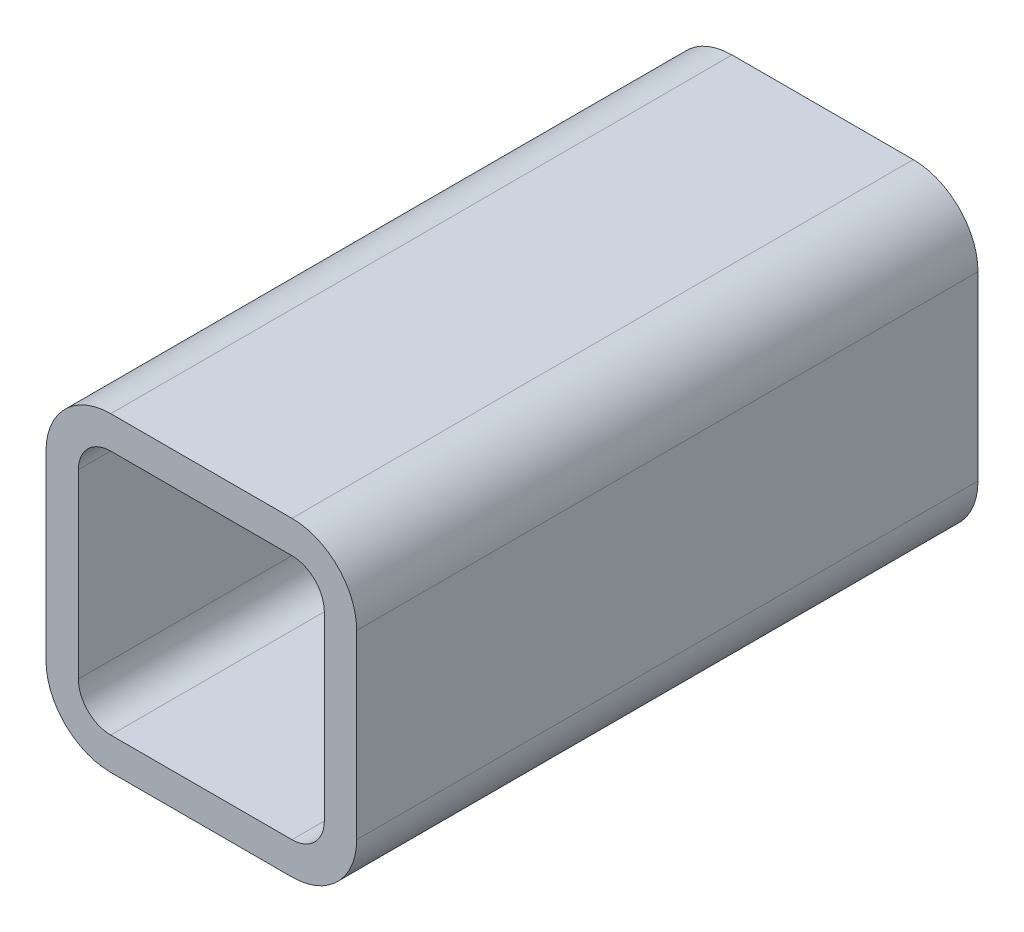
ISO-10303-21;
HEADER;
FILE_DESCRIPTION(('STEP AP214'),'2;1');
FILE_NAME('part.step','',(''),(''),'','','');
FILE_SCHEMA(('AUTOMOTIVE_DESIGN { 1 0 10303 214 1 1 1 1 }'));
ENDSEC;
DATA;
#1=APPLICATION_CONTEXT('core data for automotive mechanical design processes');
#2=APPLICATION_PROTOCOL_DEFINITION('international standard','automotive_design',2000,#1);
#3=PRODUCT_CONTEXT('',#1,'mechanical');
#4=PRODUCT('Part','Part','',(#3));
#5=PRODUCT_RELATED_PRODUCT_CATEGORY('part','',(#4));
#6=PRODUCT_DEFINITION_FORMATION('','',#4);
#7=PRODUCT_DEFINITION_CONTEXT('part definition',#1,'design');
#8=PRODUCT_DEFINITION('design','',#6,#7);
#9=PRODUCT_DEFINITION_SHAPE('','',#8);
#10=(LENGTH_UNIT() NAMED_UNIT(*) SI_UNIT(.MILLI.,.METRE.));
#11=(NAMED_UNIT(*) PLANE_ANGLE_UNIT() SI_UNIT($,.RADIAN.));
#12=(NAMED_UNIT(*) SI_UNIT($,.STERADIAN.) SOLID_ANGLE_UNIT());
#13=UNCERTAINTY_MEASURE_WITH_UNIT(LENGTH_MEASURE(1.E-05),#10,'distance_accuracy_value','');
#14=(GEOMETRIC_REPRESENTATION_CONTEXT(3) GLOBAL_UNCERTAINTY_ASSIGNED_CONTEXT((#13)) GLOBAL_UNIT_ASSIGNED_CONTEXT((#10,
#11,#12)) REPRESENTATION_CONTEXT('',''));
#15=CARTESIAN_POINT('',(0.,0.,0.));
#16=DIRECTION('',(0.,0.,1.));
#17=DIRECTION('',(1.,0.,0.));
#18=AXIS2_PLACEMENT_3D('',#15,#16,#17);
#19=CARTESIAN_POINT('',(31.7973013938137,122.661948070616,304.8));
#20=DIRECTION('',(0.,0.,1.));
#21=DIRECTION('',(1.,0.,0.));
#22=AXIS2_PLACEMENT_3D('',#19,#20,#21);
#23=PLANE('',#22);
#24=CARTESIAN_POINT('',(31.7973013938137,122.661948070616,304.8));
#25=DIRECTION('',(0.,0.,1.));
#26=DIRECTION('',(1.,0.,0.));
#27=AXIS2_PLACEMENT_3D('',#24,#25,#26);
#28=CIRCLE('',#27,31.75);
#29=CARTESIAN_POINT('',(31.7973013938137,154.411948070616,304.8));
#30=VERTEX_POINT('',#29);
#31=CARTESIAN_POINT('',(0.0473013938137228,122.661948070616,304.8));
#32=VERTEX_POINT('',#31);
#33=EDGE_CURVE('E211',#30,#32,#28,.T.);
#34=ORIENTED_EDGE('',*,*,#33,.T.);
#35=DIRECTION('',(0.,-1.,0.));
#36=VECTOR('',#35,1.);
#37=CARTESIAN_POINT('',(0.0473013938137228,122.661948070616,304.8));
#38=LINE('',#37,#36);
#39=CARTESIAN_POINT('',(0.0473013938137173,33.7619480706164,304.8));
#40=VERTEX_POINT('',#39);
#41=EDGE_CURVE('E214',#32,#40,#38,.T.);
#42=ORIENTED_EDGE('',*,*,#41,.T.);
#43=CARTESIAN_POINT('',(31.7973013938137,33.7619480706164,304.8));
#44=DIRECTION('',(0.,0.,1.));
#45=DIRECTION('',(1.,0.,0.));
#46=AXIS2_PLACEMENT_3D('',#43,#44,#45);
#47=CIRCLE('',#46,31.75);
#48=CARTESIAN_POINT('',(31.7973013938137,2.01194807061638,304.8));
#49=VERTEX_POINT('',#48);
#50=EDGE_CURVE('E217',#40,#49,#47,.T.);
#51=ORIENTED_EDGE('',*,*,#50,.T.);
#52=DIRECTION('',(1.,0.,0.));
#53=VECTOR('',#52,1.);
#54=CARTESIAN_POINT('',(31.7973013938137,2.01194807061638,304.8));
#55=LINE('',#54,#53);
#56=CARTESIAN_POINT('',(120.697301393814,2.01194807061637,304.8));
#57=VERTEX_POINT('',#56);
#58=EDGE_CURVE('E219',#49,#57,#55,.T.);
#59=ORIENTED_EDGE('',*,*,#58,.T.);
#60=CARTESIAN_POINT('',(120.697301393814,33.7619480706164,304.8));
#61=DIRECTION('',(0.,0.,1.));
#62=DIRECTION('',(1.,0.,0.));
#63=AXIS2_PLACEMENT_3D('',#60,#61,#62);
#64=CIRCLE('',#63,31.75);
#65=CARTESIAN_POINT('',(152.447301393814,33.7619480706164,304.8));
#66=VERTEX_POINT('',#65);
#67=EDGE_CURVE('E221',#57,#66,#64,.T.);
#68=ORIENTED_EDGE('',*,*,#67,.T.);
#69=DIRECTION('',(0.,1.,0.));
#70=VECTOR('',#69,1.);
#71=CARTESIAN_POINT('',(152.447301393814,33.7619480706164,304.8));
#72=LINE('',#71,#70);
#73=CARTESIAN_POINT('',(152.447301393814,122.661948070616,304.8));
#74=VERTEX_POINT('',#73);
#75=EDGE_CURVE('E223',#66,#74,#72,.T.);
#76=ORIENTED_EDGE('',*,*,#75,.T.);
#77=CARTESIAN_POINT('',(120.697301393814,122.661948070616,304.8));
#78=DIRECTION('',(0.,0.,1.));
#79=DIRECTION('',(1.,0.,0.));
#80=AXIS2_PLACEMENT_3D('',#77,#78,#79);
#81=CIRCLE('',#80,31.75);
#82=CARTESIAN_POINT('',(120.697301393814,154.411948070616,304.8));
#83=VERTEX_POINT('',#82);
#84=EDGE_CURVE('E225',#74,#83,#81,.T.);
#85=ORIENTED_EDGE('',*,*,#84,.T.);
#86=DIRECTION('',(-1.,0.,0.));
#87=VECTOR('',#86,1.);
#88=CARTESIAN_POINT('',(120.697301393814,154.411948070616,304.8));
#89=LINE('',#88,#87);
#90=EDGE_CURVE('E227',#83,#30,#89,.T.);
#91=ORIENTED_EDGE('',*,*,#90,.T.);
#92=EDGE_LOOP('',(#34,#42,#51,#59,#68,#76,#85,#91));
#93=FACE_BOUND('',#92,.T.);
#94=DIRECTION('',(0.,-1.,0.));
#95=VECTOR('',#94,1.);
#96=CARTESIAN_POINT('',(15.9223013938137,33.7619480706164,304.8));
#97=LINE('',#96,#95);
#98=CARTESIAN_POINT('',(15.9223013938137,122.661948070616,304.8));
#99=VERTEX_POINT('',#98);
#100=CARTESIAN_POINT('',(15.9223013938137,33.7619480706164,304.8));
#101=VERTEX_POINT('',#100);
#102=EDGE_CURVE('E154',#99,#101,#97,.T.);
#103=ORIENTED_EDGE('',*,*,#102,.F.);
#104=CARTESIAN_POINT('',(31.7973013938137,122.661948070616,304.8));
#105=DIRECTION('',(0.,0.,1.));
#106=DIRECTION('',(1.,0.,0.));
#107=AXIS2_PLACEMENT_3D('',#104,#105,#106);
#108=CIRCLE('',#107,15.875);
#109=CARTESIAN_POINT('',(31.7973013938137,138.536948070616,304.8));
#110=VERTEX_POINT('',#109);
#111=EDGE_CURVE('E146',#110,#99,#108,.T.);
#112=ORIENTED_EDGE('',*,*,#111,.F.);
#113=DIRECTION('',(-1.,0.,0.));
#114=VECTOR('',#113,1.);
#115=CARTESIAN_POINT('',(31.7973013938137,138.536948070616,304.8));
#116=LINE('',#115,#114);
#117=CARTESIAN_POINT('',(120.697301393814,138.536948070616,304.8));
#118=VERTEX_POINT('',#117);
#119=EDGE_CURVE('E179',#118,#110,#116,.T.);
#120=ORIENTED_EDGE('',*,*,#119,.F.);
#121=CARTESIAN_POINT('',(120.697301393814,122.661948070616,304.8));
#122=DIRECTION('',(0.,0.,1.));
#123=DIRECTION('',(1.,0.,0.));
#124=AXIS2_PLACEMENT_3D('',#121,#122,#123);
#125=CIRCLE('',#124,15.875);
#126=CARTESIAN_POINT('',(136.572301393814,122.661948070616,304.8));
#127=VERTEX_POINT('',#126);
#128=EDGE_CURVE('E177',#127,#118,#125,.T.);
#129=ORIENTED_EDGE('',*,*,#128,.F.);
#130=DIRECTION('',(0.,1.,0.));
#131=VECTOR('',#130,1.);
#132=CARTESIAN_POINT('',(136.572301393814,122.661948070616,304.8));
#133=LINE('',#132,#131);
#134=CARTESIAN_POINT('',(136.572301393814,33.7619480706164,304.8));
#135=VERTEX_POINT('',#134);
#136=EDGE_CURVE('E175',#135,#127,#133,.T.);
#137=ORIENTED_EDGE('',*,*,#136,.F.);
#138=CARTESIAN_POINT('',(120.697301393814,33.7619480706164,304.8));
#139=DIRECTION('',(0.,0.,1.));
#140=DIRECTION('',(1.,0.,0.));
#141=AXIS2_PLACEMENT_3D('',#138,#139,#140);
#142=CIRCLE('',#141,15.875);
#143=CARTESIAN_POINT('',(120.697301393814,17.8869480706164,304.8));
#144=VERTEX_POINT('',#143);
#145=EDGE_CURVE('E173',#144,#135,#142,.T.);
#146=ORIENTED_EDGE('',*,*,#145,.F.);
#147=DIRECTION('',(1.,0.,0.));
#148=VECTOR('',#147,1.);
#149=CARTESIAN_POINT('',(120.697301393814,17.8869480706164,304.8));
#150=LINE('',#149,#148);
#151=CARTESIAN_POINT('',(31.7973013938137,17.8869480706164,304.8));
#152=VERTEX_POINT('',#151);
#153=EDGE_CURVE('E169',#152,#144,#150,.T.);
#154=ORIENTED_EDGE('',*,*,#153,.F.);
#155=CARTESIAN_POINT('',(31.7973013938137,33.7619480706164,304.8));
#156=DIRECTION('',(0.,0.,1.));
#157=DIRECTION('',(1.,0.,0.));
#158=AXIS2_PLACEMENT_3D('',#155,#156,#157);
#159=CIRCLE('',#158,15.875);
#160=EDGE_CURVE('E167',#101,#152,#159,.T.);
#161=ORIENTED_EDGE('',*,*,#160,.F.);
#162=EDGE_LOOP('',(#103,#112,#120,#129,#137,#146,#154,#161));
#163=FACE_BOUND('',#162,.T.);
#164=ADVANCED_FACE('F33',(#93,#163),#23,.T.);
#165=CARTESIAN_POINT('',(31.7973013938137,122.661948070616,0.));
#166=DIRECTION('',(0.,0.,1.));
#167=DIRECTION('',(1.,0.,0.));
#168=AXIS2_PLACEMENT_3D('',#165,#166,#167);
#169=PLANE('',#168);
#170=CARTESIAN_POINT('',(31.7973013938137,122.661948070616,0.));
#171=DIRECTION('',(0.,0.,1.));
#172=DIRECTION('',(1.,0.,0.));
#173=AXIS2_PLACEMENT_3D('',#170,#171,#172);
#174=CIRCLE('',#173,31.75);
#175=CARTESIAN_POINT('',(31.7973013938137,154.411948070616,0.));
#176=VERTEX_POINT('',#175);
#177=CARTESIAN_POINT('',(0.0473013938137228,122.661948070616,0.));
#178=VERTEX_POINT('',#177);
#179=EDGE_CURVE('E162',#176,#178,#174,.T.);
#180=ORIENTED_EDGE('',*,*,#179,.F.);
#181=DIRECTION('',(-1.,0.,0.));
#182=VECTOR('',#181,1.);
#183=CARTESIAN_POINT('',(120.697301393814,154.411948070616,0.));
#184=LINE('',#183,#182);
#185=CARTESIAN_POINT('',(120.697301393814,154.411948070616,0.));
#186=VERTEX_POINT('',#185);
#187=EDGE_CURVE('E215',#186,#176,#184,.T.);
#188=ORIENTED_EDGE('',*,*,#187,.F.);
#189=CARTESIAN_POINT('',(120.697301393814,122.661948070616,0.));
#190=DIRECTION('',(0.,0.,1.));
#191=DIRECTION('',(1.,0.,0.));
#192=AXIS2_PLACEMENT_3D('',#189,#190,#191);
#193=CIRCLE('',#192,31.75);
#194=CARTESIAN_POINT('',(152.447301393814,122.661948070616,0.));
#195=VERTEX_POINT('',#194);
#196=EDGE_CURVE('E242',#195,#186,#193,.T.);
#197=ORIENTED_EDGE('',*,*,#196,.F.);
#198=DIRECTION('',(0.,1.,0.));
#199=VECTOR('',#198,1.);
#200=CARTESIAN_POINT('',(152.447301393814,33.7619480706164,0.));
#201=LINE('',#200,#199);
#202=CARTESIAN_POINT('',(152.447301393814,33.7619480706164,0.));
#203=VERTEX_POINT('',#202);
#204=EDGE_CURVE('E240',#203,#195,#201,.T.);
#205=ORIENTED_EDGE('',*,*,#204,.F.);
#206=CARTESIAN_POINT('',(120.697301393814,33.7619480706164,0.));
#207=DIRECTION('',(0.,0.,1.));
#208=DIRECTION('',(1.,0.,0.));
#209=AXIS2_PLACEMENT_3D('',#206,#207,#208);
#210=CIRCLE('',#209,31.75);
#211=CARTESIAN_POINT('',(120.697301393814,2.01194807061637,0.));
#212=VERTEX_POINT('',#211);
#213=EDGE_CURVE('E238',#212,#203,#210,.T.);
#214=ORIENTED_EDGE('',*,*,#213,.F.);
#215=DIRECTION('',(1.,0.,0.));
#216=VECTOR('',#215,1.);
#217=CARTESIAN_POINT('',(31.7973013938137,2.01194807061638,0.));
#218=LINE('',#217,#216);
#219=CARTESIAN_POINT('',(31.7973013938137,2.01194807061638,0.));
#220=VERTEX_POINT('',#219);
#221=EDGE_CURVE('E236',#220,#212,#218,.T.);
#222=ORIENTED_EDGE('',*,*,#221,.F.);
#223=CARTESIAN_POINT('',(31.7973013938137,33.7619480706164,0.));
#224=DIRECTION('',(0.,0.,1.));
#225=DIRECTION('',(1.,0.,0.));
#226=AXIS2_PLACEMENT_3D('',#223,#224,#225);
#227=CIRCLE('',#226,31.75);
#228=CARTESIAN_POINT('',(0.0473013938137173,33.7619480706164,0.));
#229=VERTEX_POINT('',#228);
#230=EDGE_CURVE('E234',#229,#220,#227,.T.);
#231=ORIENTED_EDGE('',*,*,#230,.F.);
#232=DIRECTION('',(0.,-1.,0.));
#233=VECTOR('',#232,1.);
#234=CARTESIAN_POINT('',(0.0473013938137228,122.661948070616,0.));
#235=LINE('',#234,#233);
#236=EDGE_CURVE('E232',#178,#229,#235,.T.);
#237=ORIENTED_EDGE('',*,*,#236,.F.);
#238=EDGE_LOOP('',(#180,#188,#197,#205,#214,#222,#231,#237));
#239=FACE_BOUND('',#238,.T.);
#240=CARTESIAN_POINT('',(31.7973013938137,122.661948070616,0.));
#241=DIRECTION('',(0.,0.,1.));
#242=DIRECTION('',(1.,0.,0.));
#243=AXIS2_PLACEMENT_3D('',#240,#241,#242);
#244=CIRCLE('',#243,15.875);
#245=CARTESIAN_POINT('',(31.7973013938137,138.536948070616,0.));
#246=VERTEX_POINT('',#245);
#247=CARTESIAN_POINT('',(15.9223013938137,122.661948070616,0.));
#248=VERTEX_POINT('',#247);
#249=EDGE_CURVE('E56',#246,#248,#244,.T.);
#250=ORIENTED_EDGE('',*,*,#249,.T.);
#251=DIRECTION('',(0.,-1.,0.));
#252=VECTOR('',#251,1.);
#253=CARTESIAN_POINT('',(15.9223013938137,33.7619480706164,0.));
#254=LINE('',#253,#252);
#255=CARTESIAN_POINT('',(15.9223013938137,33.7619480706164,0.));
#256=VERTEX_POINT('',#255);
#257=EDGE_CURVE('E161',#248,#256,#254,.T.);
#258=ORIENTED_EDGE('',*,*,#257,.T.);
#259=CARTESIAN_POINT('',(31.7973013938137,33.7619480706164,0.));
#260=DIRECTION('',(0.,0.,1.));
#261=DIRECTION('',(1.,0.,0.));
#262=AXIS2_PLACEMENT_3D('',#259,#260,#261);
#263=CIRCLE('',#262,15.875);
#264=CARTESIAN_POINT('',(31.7973013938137,17.8869480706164,0.));
#265=VERTEX_POINT('',#264);
#266=EDGE_CURVE('E183',#256,#265,#263,.T.);
#267=ORIENTED_EDGE('',*,*,#266,.T.);
#268=DIRECTION('',(1.,0.,0.));
#269=VECTOR('',#268,1.);
#270=CARTESIAN_POINT('',(120.697301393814,17.8869480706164,0.));
#271=LINE('',#270,#269);
#272=CARTESIAN_POINT('',(120.697301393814,17.8869480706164,0.));
#273=VERTEX_POINT('',#272);
#274=EDGE_CURVE('E186',#265,#273,#271,.T.);
#275=ORIENTED_EDGE('',*,*,#274,.T.);
#276=CARTESIAN_POINT('',(120.697301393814,33.7619480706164,0.));
#277=DIRECTION('',(0.,0.,1.));
#278=DIRECTION('',(1.,0.,0.));
#279=AXIS2_PLACEMENT_3D('',#276,#277,#278);
#280=CIRCLE('',#279,15.875);
#281=CARTESIAN_POINT('',(136.572301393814,33.7619480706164,0.));
#282=VERTEX_POINT('',#281);
#283=EDGE_CURVE('E189',#273,#282,#280,.T.);
#284=ORIENTED_EDGE('',*,*,#283,.T.);
#285=DIRECTION('',(0.,1.,0.));
#286=VECTOR('',#285,1.);
#287=CARTESIAN_POINT('',(136.572301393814,122.661948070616,0.));
#288=LINE('',#287,#286);
#289=CARTESIAN_POINT('',(136.572301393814,122.661948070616,0.));
#290=VERTEX_POINT('',#289);
#291=EDGE_CURVE('E192',#282,#290,#288,.T.);
#292=ORIENTED_EDGE('',*,*,#291,.T.);
#293=CARTESIAN_POINT('',(120.697301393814,122.661948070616,0.));
#294=DIRECTION('',(0.,0.,1.));
#295=DIRECTION('',(1.,0.,0.));
#296=AXIS2_PLACEMENT_3D('',#293,#294,#295);
#297=CIRCLE('',#296,15.875);
#298=CARTESIAN_POINT('',(120.697301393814,138.536948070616,0.));
#299=VERTEX_POINT('',#298);
#300=EDGE_CURVE('E195',#290,#299,#297,.T.);
#301=ORIENTED_EDGE('',*,*,#300,.T.);
#302=DIRECTION('',(-1.,0.,0.));
#303=VECTOR('',#302,1.);
#304=CARTESIAN_POINT('',(31.7973013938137,138.536948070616,0.));
#305=LINE('',#304,#303);
#306=EDGE_CURVE('E155',#299,#246,#305,.T.);
#307=ORIENTED_EDGE('',*,*,#306,.T.);
#308=EDGE_LOOP('',(#250,#258,#267,#275,#284,#292,#301,#307));
#309=FACE_BOUND('',#308,.T.);
#310=ADVANCED_FACE('F272',(#239,#309),#169,.F.);
#311=CARTESIAN_POINT('',(31.7973013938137,122.661948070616,304.8));
#312=DIRECTION('',(0.,0.,-1.));
#313=DIRECTION('',(-1.,0.,0.));
#314=AXIS2_PLACEMENT_3D('',#311,#312,#313);
#315=CYLINDRICAL_SURFACE('',#314,31.75);
#316=ORIENTED_EDGE('',*,*,#179,.T.);
#317=DIRECTION('',(0.,0.,-1.));
#318=VECTOR('',#317,1.);
#319=CARTESIAN_POINT('',(0.0473013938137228,122.661948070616,304.8));
#320=LINE('',#319,#318);
#321=EDGE_CURVE('E11',#32,#178,#320,.T.);
#322=ORIENTED_EDGE('',*,*,#321,.F.);
#323=ORIENTED_EDGE('',*,*,#33,.F.);
#324=DIRECTION('',(0.,0.,-1.));
#325=VECTOR('',#324,1.);
#326=CARTESIAN_POINT('',(31.7973013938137,154.411948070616,304.8));
#327=LINE('',#326,#325);
#328=EDGE_CURVE('E229',#30,#176,#327,.T.);
#329=ORIENTED_EDGE('',*,*,#328,.T.);
#330=EDGE_LOOP('',(#316,#322,#323,#329));
#331=FACE_BOUND('',#330,.T.);
#332=ADVANCED_FACE('F35',(#331),#315,.T.);
#333=CARTESIAN_POINT('',(0.0473013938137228,122.661948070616,304.8));
#334=DIRECTION('',(1.,0.,0.));
#335=DIRECTION('',(0.,0.,-1.));
#336=AXIS2_PLACEMENT_3D('',#333,#334,#335);
#337=PLANE('',#336);
#338=ORIENTED_EDGE('',*,*,#236,.T.);
#339=DIRECTION('',(0.,0.,-1.));
#340=VECTOR('',#339,1.);
#341=CARTESIAN_POINT('',(0.0473013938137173,33.7619480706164,304.8));
#342=LINE('',#341,#340);
#343=EDGE_CURVE('E41',#40,#229,#342,.T.);
#344=ORIENTED_EDGE('',*,*,#343,.F.);
#345=ORIENTED_EDGE('',*,*,#41,.F.);
#346=ORIENTED_EDGE('',*,*,#321,.T.);
#347=EDGE_LOOP('',(#338,#344,#345,#346));
#348=FACE_BOUND('',#347,.T.);
#349=ADVANCED_FACE('F289',(#348),#337,.F.);
#350=CARTESIAN_POINT('',(31.7973013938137,33.7619480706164,304.8));
#351=DIRECTION('',(0.,0.,-1.));
#352=DIRECTION('',(-1.,0.,0.));
#353=AXIS2_PLACEMENT_3D('',#350,#351,#352);
#354=CYLINDRICAL_SURFACE('',#353,31.75);
#355=ORIENTED_EDGE('',*,*,#230,.T.);
#356=DIRECTION('',(0.,0.,-1.));
#357=VECTOR('',#356,1.);
#358=CARTESIAN_POINT('',(31.7973013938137,2.01194807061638,304.8));
#359=LINE('',#358,#357);
#360=EDGE_CURVE('E259',#49,#220,#359,.T.);
#361=ORIENTED_EDGE('',*,*,#360,.F.);
#362=ORIENTED_EDGE('',*,*,#50,.F.);
#363=ORIENTED_EDGE('',*,*,#343,.T.);
#364=EDGE_LOOP('',(#355,#361,#362,#363));
#365=FACE_BOUND('',#364,.T.);
#366=ADVANCED_FACE('F266',(#365),#354,.T.);
#367=CARTESIAN_POINT('',(31.7973013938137,2.01194807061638,304.8));
#368=DIRECTION('',(0.,1.,0.));
#369=DIRECTION('',(0.,0.,1.));
#370=AXIS2_PLACEMENT_3D('',#367,#368,#369);
#371=PLANE('',#370);
#372=ORIENTED_EDGE('',*,*,#221,.T.);
#373=DIRECTION('',(0.,0.,-1.));
#374=VECTOR('',#373,1.);
#375=CARTESIAN_POINT('',(120.697301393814,2.01194807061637,304.8));
#376=LINE('',#375,#374);
#377=EDGE_CURVE('E256',#57,#212,#376,.T.);
#378=ORIENTED_EDGE('',*,*,#377,.F.);
#379=ORIENTED_EDGE('',*,*,#58,.F.);
#380=ORIENTED_EDGE('',*,*,#360,.T.);
#381=EDGE_LOOP('',(#372,#378,#379,#380));
#382=FACE_BOUND('',#381,.T.);
#383=ADVANCED_FACE('F278',(#382),#371,.F.);
#384=CARTESIAN_POINT('',(120.697301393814,33.7619480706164,304.8));
#385=DIRECTION('',(0.,0.,-1.));
#386=DIRECTION('',(-1.,0.,0.));
#387=AXIS2_PLACEMENT_3D('',#384,#385,#386);
#388=CYLINDRICAL_SURFACE('',#387,31.75);
#389=ORIENTED_EDGE('',*,*,#213,.T.);
#390=DIRECTION('',(0.,0.,-1.));
#391=VECTOR('',#390,1.);
#392=CARTESIAN_POINT('',(152.447301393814,33.7619480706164,304.8));
#393=LINE('',#392,#391);
#394=EDGE_CURVE('E253',#66,#203,#393,.T.);
#395=ORIENTED_EDGE('',*,*,#394,.F.);
#396=ORIENTED_EDGE('',*,*,#67,.F.);
#397=ORIENTED_EDGE('',*,*,#377,.T.);
#398=EDGE_LOOP('',(#389,#395,#396,#397));
#399=FACE_BOUND('',#398,.T.);
#400=ADVANCED_FACE('F282',(#399),#388,.T.);
#401=CARTESIAN_POINT('',(152.447301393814,33.7619480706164,304.8));
#402=DIRECTION('',(-1.,0.,0.));
#403=DIRECTION('',(0.,0.,1.));
#404=AXIS2_PLACEMENT_3D('',#401,#402,#403);
#405=PLANE('',#404);
#406=ORIENTED_EDGE('',*,*,#204,.T.);
#407=DIRECTION('',(0.,0.,-1.));
#408=VECTOR('',#407,1.);
#409=CARTESIAN_POINT('',(152.447301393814,122.661948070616,304.8));
#410=LINE('',#409,#408);
#411=EDGE_CURVE('E250',#74,#195,#410,.T.);
#412=ORIENTED_EDGE('',*,*,#411,.F.);
#413=ORIENTED_EDGE('',*,*,#75,.F.);
#414=ORIENTED_EDGE('',*,*,#394,.T.);
#415=EDGE_LOOP('',(#406,#412,#413,#414));
#416=FACE_BOUND('',#415,.T.);
#417=ADVANCED_FACE('F302',(#416),#405,.F.);
#418=CARTESIAN_POINT('',(120.697301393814,122.661948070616,304.8));
#419=DIRECTION('',(0.,0.,-1.));
#420=DIRECTION('',(-1.,0.,0.));
#421=AXIS2_PLACEMENT_3D('',#418,#419,#420);
#422=CYLINDRICAL_SURFACE('',#421,31.75);
#423=ORIENTED_EDGE('',*,*,#196,.T.);
#424=DIRECTION('',(0.,0.,-1.));
#425=VECTOR('',#424,1.);
#426=CARTESIAN_POINT('',(120.697301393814,154.411948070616,304.8));
#427=LINE('',#426,#425);
#428=EDGE_CURVE('E247',#83,#186,#427,.T.);
#429=ORIENTED_EDGE('',*,*,#428,.F.);
#430=ORIENTED_EDGE('',*,*,#84,.F.);
#431=ORIENTED_EDGE('',*,*,#411,.T.);
#432=EDGE_LOOP('',(#423,#429,#430,#431));
#433=FACE_BOUND('',#432,.T.);
#434=ADVANCED_FACE('F300',(#433),#422,.T.);
#435=CARTESIAN_POINT('',(120.697301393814,154.411948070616,304.8));
#436=DIRECTION('',(0.,-1.,0.));
#437=DIRECTION('',(0.,0.,-1.));
#438=AXIS2_PLACEMENT_3D('',#435,#436,#437);
#439=PLANE('',#438);
#440=ORIENTED_EDGE('',*,*,#187,.T.);
#441=ORIENTED_EDGE('',*,*,#328,.F.);
#442=ORIENTED_EDGE('',*,*,#90,.F.);
#443=ORIENTED_EDGE('',*,*,#428,.T.);
#444=EDGE_LOOP('',(#440,#441,#442,#443));
#445=FACE_BOUND('',#444,.T.);
#446=ADVANCED_FACE('F295',(#445),#439,.F.);
#447=CARTESIAN_POINT('',(31.7973013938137,122.661948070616,304.8));
#448=DIRECTION('',(0.,0.,-1.));
#449=DIRECTION('',(-1.,0.,0.));
#450=AXIS2_PLACEMENT_3D('',#447,#448,#449);
#451=CYLINDRICAL_SURFACE('',#450,15.875);
#452=ORIENTED_EDGE('',*,*,#249,.F.);
#453=DIRECTION('',(0.,0.,-1.));
#454=VECTOR('',#453,1.);
#455=CARTESIAN_POINT('',(31.7973013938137,138.536948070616,304.8));
#456=LINE('',#455,#454);
#457=EDGE_CURVE('E150',#110,#246,#456,.T.);
#458=ORIENTED_EDGE('',*,*,#457,.F.);
#459=ORIENTED_EDGE('',*,*,#111,.T.);
#460=DIRECTION('',(0.,0.,-1.));
#461=VECTOR('',#460,1.);
#462=CARTESIAN_POINT('',(15.9223013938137,122.661948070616,304.8));
#463=LINE('',#462,#461);
#464=EDGE_CURVE('E149',#99,#248,#463,.T.);
#465=ORIENTED_EDGE('',*,*,#464,.T.);
#466=EDGE_LOOP('',(#452,#458,#459,#465));
#467=FACE_BOUND('',#466,.T.);
#468=ADVANCED_FACE('F148',(#467),#451,.F.);
#469=CARTESIAN_POINT('',(15.9223013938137,33.7619480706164,304.8));
#470=DIRECTION('',(1.,0.,0.));
#471=DIRECTION('',(0.,0.,-1.));
#472=AXIS2_PLACEMENT_3D('',#469,#470,#471);
#473=PLANE('',#472);
#474=ORIENTED_EDGE('',*,*,#257,.F.);
#475=ORIENTED_EDGE('',*,*,#464,.F.);
#476=ORIENTED_EDGE('',*,*,#102,.T.);
#477=DIRECTION('',(0.,0.,-1.));
#478=VECTOR('',#477,1.);
#479=CARTESIAN_POINT('',(15.9223013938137,33.7619480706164,304.8));
#480=LINE('',#479,#478);
#481=EDGE_CURVE('E163',#101,#256,#480,.T.);
#482=ORIENTED_EDGE('',*,*,#481,.T.);
#483=EDGE_LOOP('',(#474,#475,#476,#482));
#484=FACE_BOUND('',#483,.T.);
#485=ADVANCED_FACE('F158',(#484),#473,.T.);
#486=CARTESIAN_POINT('',(31.7973013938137,33.7619480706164,304.8));
#487=DIRECTION('',(0.,0.,-1.));
#488=DIRECTION('',(-1.,0.,0.));
#489=AXIS2_PLACEMENT_3D('',#486,#487,#488);
#490=CYLINDRICAL_SURFACE('',#489,15.875);
#491=ORIENTED_EDGE('',*,*,#266,.F.);
#492=ORIENTED_EDGE('',*,*,#481,.F.);
#493=ORIENTED_EDGE('',*,*,#160,.T.);
#494=DIRECTION('',(0.,0.,-1.));
#495=VECTOR('',#494,1.);
#496=CARTESIAN_POINT('',(31.7973013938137,17.8869480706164,304.8));
#497=LINE('',#496,#495);
#498=EDGE_CURVE('E208',#152,#265,#497,.T.);
#499=ORIENTED_EDGE('',*,*,#498,.T.);
#500=EDGE_LOOP('',(#491,#492,#493,#499));
#501=FACE_BOUND('',#500,.T.);
#502=ADVANCED_FACE('F327',(#501),#490,.F.);
#503=CARTESIAN_POINT('',(120.697301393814,17.8869480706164,304.8));
#504=DIRECTION('',(0.,1.,0.));
#505=DIRECTION('',(0.,0.,1.));
#506=AXIS2_PLACEMENT_3D('',#503,#504,#505);
#507=PLANE('',#506);
#508=ORIENTED_EDGE('',*,*,#274,.F.);
#509=ORIENTED_EDGE('',*,*,#498,.F.);
#510=ORIENTED_EDGE('',*,*,#153,.T.);
#511=DIRECTION('',(0.,0.,-1.));
#512=VECTOR('',#511,1.);
#513=CARTESIAN_POINT('',(120.697301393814,17.8869480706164,304.8));
#514=LINE('',#513,#512);
#515=EDGE_CURVE('E206',#144,#273,#514,.T.);
#516=ORIENTED_EDGE('',*,*,#515,.T.);
#517=EDGE_LOOP('',(#508,#509,#510,#516));
#518=FACE_BOUND('',#517,.T.);
#519=ADVANCED_FACE('F331',(#518),#507,.T.);
#520=CARTESIAN_POINT('',(120.697301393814,33.7619480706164,304.8));
#521=DIRECTION('',(0.,0.,-1.));
#522=DIRECTION('',(-1.,0.,0.));
#523=AXIS2_PLACEMENT_3D('',#520,#521,#522);
#524=CYLINDRICAL_SURFACE('',#523,15.875);
#525=ORIENTED_EDGE('',*,*,#283,.F.);
#526=ORIENTED_EDGE('',*,*,#515,.F.);
#527=ORIENTED_EDGE('',*,*,#145,.T.);
#528=DIRECTION('',(0.,0.,-1.));
#529=VECTOR('',#528,1.);
#530=CARTESIAN_POINT('',(136.572301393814,33.7619480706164,304.8));
#531=LINE('',#530,#529);
#532=EDGE_CURVE('E204',#135,#282,#531,.T.);
#533=ORIENTED_EDGE('',*,*,#532,.T.);
#534=EDGE_LOOP('',(#525,#526,#527,#533));
#535=FACE_BOUND('',#534,.T.);
#536=ADVANCED_FACE('F337',(#535),#524,.F.);
#537=CARTESIAN_POINT('',(136.572301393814,122.661948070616,304.8));
#538=DIRECTION('',(-1.,0.,0.));
#539=DIRECTION('',(0.,0.,1.));
#540=AXIS2_PLACEMENT_3D('',#537,#538,#539);
#541=PLANE('',#540);
#542=ORIENTED_EDGE('',*,*,#291,.F.);
#543=ORIENTED_EDGE('',*,*,#532,.F.);
#544=ORIENTED_EDGE('',*,*,#136,.T.);
#545=DIRECTION('',(0.,0.,-1.));
#546=VECTOR('',#545,1.);
#547=CARTESIAN_POINT('',(136.572301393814,122.661948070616,304.8));
#548=LINE('',#547,#546);
#549=EDGE_CURVE('E202',#127,#290,#548,.T.);
#550=ORIENTED_EDGE('',*,*,#549,.T.);
#551=EDGE_LOOP('',(#542,#543,#544,#550));
#552=FACE_BOUND('',#551,.T.);
#553=ADVANCED_FACE('F341',(#552),#541,.T.);
#554=CARTESIAN_POINT('',(120.697301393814,122.661948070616,304.8));
#555=DIRECTION('',(0.,0.,-1.));
#556=DIRECTION('',(-1.,0.,0.));
#557=AXIS2_PLACEMENT_3D('',#554,#555,#556);
#558=CYLINDRICAL_SURFACE('',#557,15.875);
#559=ORIENTED_EDGE('',*,*,#300,.F.);
#560=ORIENTED_EDGE('',*,*,#549,.F.);
#561=ORIENTED_EDGE('',*,*,#128,.T.);
#562=DIRECTION('',(0.,0.,-1.));
#563=VECTOR('',#562,1.);
#564=CARTESIAN_POINT('',(120.697301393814,138.536948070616,304.8));
#565=LINE('',#564,#563);
#566=EDGE_CURVE('E48',#118,#299,#565,.T.);
#567=ORIENTED_EDGE('',*,*,#566,.T.);
#568=EDGE_LOOP('',(#559,#560,#561,#567));
#569=FACE_BOUND('',#568,.T.);
#570=ADVANCED_FACE('F345',(#569),#558,.F.);
#571=CARTESIAN_POINT('',(31.7973013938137,138.536948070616,304.8));
#572=DIRECTION('',(0.,-1.,0.));
#573=DIRECTION('',(0.,0.,-1.));
#574=AXIS2_PLACEMENT_3D('',#571,#572,#573);
#575=PLANE('',#574);
#576=ORIENTED_EDGE('',*,*,#306,.F.);
#577=ORIENTED_EDGE('',*,*,#566,.F.);
#578=ORIENTED_EDGE('',*,*,#119,.T.);
#579=ORIENTED_EDGE('',*,*,#457,.T.);
#580=EDGE_LOOP('',(#576,#577,#578,#579));
#581=FACE_BOUND('',#580,.T.);
#582=ADVANCED_FACE('F349',(#581),#575,.T.);
#583=CLOSED_SHELL('',(#164,#310,#332,#349,#366,#383,#400,#417,#434,#446,#468,#485,#502,#519,
#536,#553,#570,#582));
#584=MANIFOLD_SOLID_BREP('B2',#583);
#585=ADVANCED_BREP_SHAPE_REPRESENTATION('',(#18,#584),#14);
#586=SHAPE_DEFINITION_REPRESENTATION(#9,#585);
ENDSEC;
END-ISO-10303-21;
